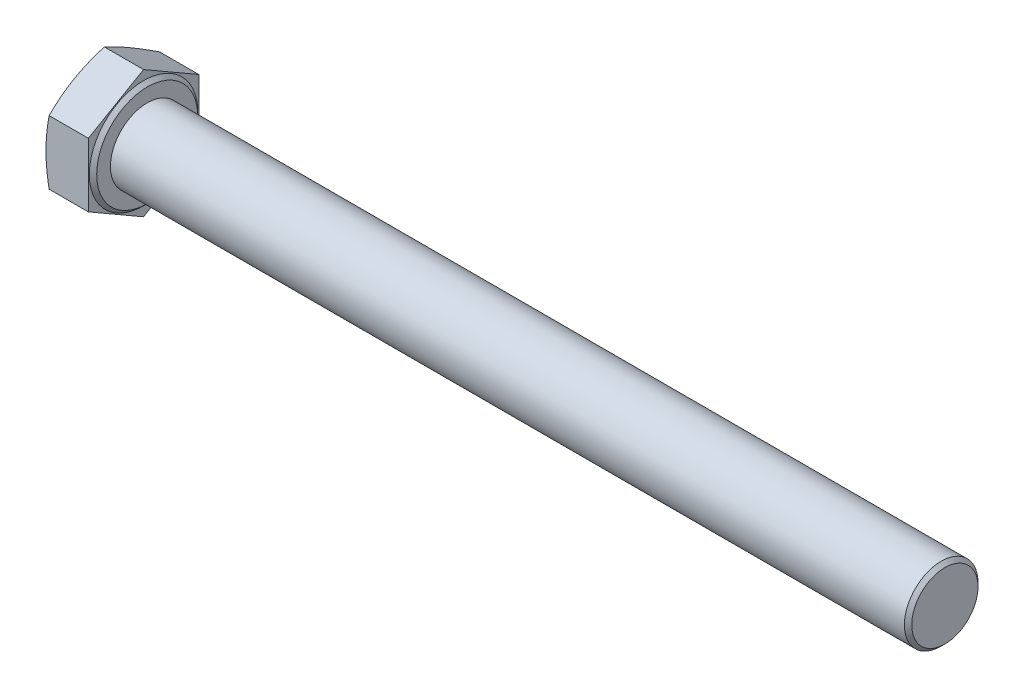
ISO-10303-21;
HEADER;
FILE_DESCRIPTION(('STEP AP214'),'2;1');
FILE_NAME('part.step','',(''),(''),'','','');
FILE_SCHEMA(('AUTOMOTIVE_DESIGN { 1 0 10303 214 1 1 1 1 }'));
ENDSEC;
DATA;
#1=APPLICATION_CONTEXT('core data for automotive mechanical design processes');
#2=APPLICATION_PROTOCOL_DEFINITION('international standard','automotive_design',2000,#1);
#3=PRODUCT_CONTEXT('',#1,'mechanical');
#4=PRODUCT('Part','Part','',(#3));
#5=PRODUCT_RELATED_PRODUCT_CATEGORY('part','',(#4));
#6=PRODUCT_DEFINITION_FORMATION('','',#4);
#7=PRODUCT_DEFINITION_CONTEXT('part definition',#1,'design');
#8=PRODUCT_DEFINITION('design','',#6,#7);
#9=PRODUCT_DEFINITION_SHAPE('','',#8);
#10=(LENGTH_UNIT() NAMED_UNIT(*) SI_UNIT(.MILLI.,.METRE.));
#11=(NAMED_UNIT(*) PLANE_ANGLE_UNIT() SI_UNIT($,.RADIAN.));
#12=(NAMED_UNIT(*) SI_UNIT($,.STERADIAN.) SOLID_ANGLE_UNIT());
#13=UNCERTAINTY_MEASURE_WITH_UNIT(LENGTH_MEASURE(1.E-05),#10,'distance_accuracy_value','');
#14=(GEOMETRIC_REPRESENTATION_CONTEXT(3) GLOBAL_UNCERTAINTY_ASSIGNED_CONTEXT((#13)) GLOBAL_UNIT_ASSIGNED_CONTEXT((#10,
#11,#12)) REPRESENTATION_CONTEXT('',''));
#15=CARTESIAN_POINT('',(0.,0.,0.));
#16=DIRECTION('',(0.,0.,1.));
#17=DIRECTION('',(1.,0.,0.));
#18=AXIS2_PLACEMENT_3D('',#15,#16,#17);
#19=CARTESIAN_POINT('',(7.5,0.,18.));
#20=DIRECTION('',(-1.,0.,0.));
#21=DIRECTION('',(0.,0.,1.));
#22=AXIS2_PLACEMENT_3D('',#19,#20,#21);
#23=PLANE('',#22);
#24=CARTESIAN_POINT('',(7.5,0.,0.));
#25=DIRECTION('',(-1.,0.,0.));
#26=DIRECTION('',(0.,0.,1.));
#27=AXIS2_PLACEMENT_3D('',#24,#25,#26);
#28=CIRCLE('',#27,8.235);
#29=CARTESIAN_POINT('',(7.5,0.,8.235));
#30=VERTEX_POINT('',#29);
#31=EDGE_CURVE('E254',#30,#30,#28,.T.);
#32=ORIENTED_EDGE('',*,*,#31,.F.);
#33=EDGE_LOOP('',(#32));
#34=FACE_BOUND('',#33,.T.);
#35=CARTESIAN_POINT('',(7.50000000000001,0.,0.));
#36=DIRECTION('',(-1.,0.,0.));
#37=DIRECTION('',(0.,0.,1.));
#38=AXIS2_PLACEMENT_3D('',#35,#36,#37);
#39=CIRCLE('',#38,6.);
#40=CARTESIAN_POINT('',(7.50000000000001,0.,6.));
#41=VERTEX_POINT('',#40);
#42=EDGE_CURVE('E149',#41,#41,#39,.F.);
#43=ORIENTED_EDGE('',*,*,#42,.F.);
#44=EDGE_LOOP('',(#43));
#45=FACE_BOUND('',#44,.T.);
#46=ADVANCED_FACE('F31',(#34,#45),#23,.F.);
#47=CARTESIAN_POINT('',(7.5,-5.19615242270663,9.));
#48=DIRECTION('',(0.,0.866025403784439,-0.5));
#49=DIRECTION('',(0.,0.5,0.866025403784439));
#50=AXIS2_PLACEMENT_3D('',#47,#48,#49);
#51=PLANE('',#50);
#52=CARTESIAN_POINT('',(0.506799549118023,-10.3924203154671,-0.000200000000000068));
#53=CARTESIAN_POINT('',(0.428447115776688,-10.1772266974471,0.37252627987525));
#54=CARTESIAN_POINT('',(0.357172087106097,-9.96132347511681,0.746481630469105));
#55=CARTESIAN_POINT('',(0.231774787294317,-9.52811323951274,1.49682376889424));
#56=CARTESIAN_POINT('',(0.177665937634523,-9.31080526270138,1.87321222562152));
#57=CARTESIAN_POINT('',(0.0901464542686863,-8.87719707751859,2.62424363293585));
#58=CARTESIAN_POINT('',(0.0565449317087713,-8.66090677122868,2.9988694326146));
#59=CARTESIAN_POINT('',(0.0114758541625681,-8.22782037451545,3.74899707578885));
#60=CARTESIAN_POINT('',(0.,-8.0110245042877,4.12449853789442));
#61=CARTESIAN_POINT('',(0.,-7.57743276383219,4.87550146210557));
#62=CARTESIAN_POINT('',(0.0114758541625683,-7.36063689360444,5.25100292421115));
#63=CARTESIAN_POINT('',(0.0565449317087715,-6.92755049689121,6.0011305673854));
#64=CARTESIAN_POINT('',(0.0901464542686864,-6.7112601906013,6.37575636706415));
#65=CARTESIAN_POINT('',(0.177665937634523,-6.27765200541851,7.12678777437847));
#66=CARTESIAN_POINT('',(0.231774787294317,-6.06034402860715,7.50317623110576));
#67=CARTESIAN_POINT('',(0.357172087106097,-5.62713379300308,8.25351836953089));
#68=CARTESIAN_POINT('',(0.428447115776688,-5.41123057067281,8.62747372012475));
#69=CARTESIAN_POINT('',(0.506799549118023,-5.19603695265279,9.0002));
#70=B_SPLINE_CURVE_WITH_KNOTS('',3,(#52,#53,#54,#55,#56,#57,#58,#59,#60,#61,#62,#63,#64,#65,#66,
#67,#68,#69),.UNSPECIFIED.,.F.,.F.,(4,2,2,2,2,2,2,2,4),(0.,1.3125188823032,2.62606145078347,
3.9271828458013,5.22781610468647,6.52844936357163,7.82957075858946,9.14311332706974,
10.4556322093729),.UNSPECIFIED.);
#71=CARTESIAN_POINT('',(0.506757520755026,-10.3923048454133,0.));
#72=VERTEX_POINT('',#71);
#73=CARTESIAN_POINT('',(0.,-7.79422863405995,4.5));
#74=VERTEX_POINT('',#73);
#75=EDGE_CURVE('E273',#72,#74,#70,.T.);
#76=ORIENTED_EDGE('',*,*,#75,.F.);
#77=DIRECTION('',(-1.,0.,0.));
#78=VECTOR('',#77,1.);
#79=CARTESIAN_POINT('',(7.5,-10.3923048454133,0.));
#80=LINE('',#79,#78);
#81=CARTESIAN_POINT('',(6.9,-10.3923048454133,0.));
#82=VERTEX_POINT('',#81);
#83=EDGE_CURVE('E142',#82,#72,#80,.T.);
#84=ORIENTED_EDGE('',*,*,#83,.F.);
#85=DIRECTION('',(0.,-0.5,-0.866025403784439));
#86=VECTOR('',#85,1.);
#87=CARTESIAN_POINT('',(6.9,-5.19615242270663,9.));
#88=LINE('',#87,#86);
#89=CARTESIAN_POINT('',(6.9,-5.19615242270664,9.));
#90=VERTEX_POINT('',#89);
#91=EDGE_CURVE('E133',#90,#82,#88,.T.);
#92=ORIENTED_EDGE('',*,*,#91,.F.);
#93=DIRECTION('',(-1.,0.,0.));
#94=VECTOR('',#93,1.);
#95=CARTESIAN_POINT('',(7.5,-5.19615242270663,9.));
#96=LINE('',#95,#94);
#97=CARTESIAN_POINT('',(0.506757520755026,-5.19615242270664,9.));
#98=VERTEX_POINT('',#97);
#99=EDGE_CURVE('E128',#90,#98,#96,.T.);
#100=ORIENTED_EDGE('',*,*,#99,.T.);
#101=EDGE_CURVE('E122',#74,#98,#70,.T.);
#102=ORIENTED_EDGE('',*,*,#101,.F.);
#103=EDGE_LOOP('',(#76,#84,#92,#100,#102));
#104=FACE_BOUND('',#103,.T.);
#105=ADVANCED_FACE('F165',(#104),#51,.F.);
#106=CARTESIAN_POINT('',(7.5,-10.3923048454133,0.));
#107=DIRECTION('',(0.,0.866025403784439,0.5));
#108=DIRECTION('',(0.,-0.5,0.866025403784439));
#109=AXIS2_PLACEMENT_3D('',#106,#107,#108);
#110=PLANE('',#109);
#111=CARTESIAN_POINT('',(0.506799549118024,-5.1960369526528,-9.0002));
#112=CARTESIAN_POINT('',(0.428447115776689,-5.41123057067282,-8.62747372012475));
#113=CARTESIAN_POINT('',(0.357172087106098,-5.62713379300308,-8.25351836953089));
#114=CARTESIAN_POINT('',(0.231774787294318,-6.06034402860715,-7.50317623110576));
#115=CARTESIAN_POINT('',(0.177665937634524,-6.27765200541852,-7.12678777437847));
#116=CARTESIAN_POINT('',(0.0901464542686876,-6.71126019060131,-6.37575636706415));
#117=CARTESIAN_POINT('',(0.0565449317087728,-6.92755049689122,-6.00113056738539));
#118=CARTESIAN_POINT('',(0.0114758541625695,-7.36063689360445,-5.25100292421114));
#119=CARTESIAN_POINT('',(0.,-7.5774327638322,-4.87550146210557));
#120=CARTESIAN_POINT('',(0.,-8.0110245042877,-4.12449853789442));
#121=CARTESIAN_POINT('',(0.0114758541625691,-8.22782037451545,-3.74899707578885));
#122=CARTESIAN_POINT('',(0.0565449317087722,-8.66090677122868,-2.9988694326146));
#123=CARTESIAN_POINT('',(0.090146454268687,-8.87719707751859,-2.62424363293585));
#124=CARTESIAN_POINT('',(0.177665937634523,-9.31080526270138,-1.87321222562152));
#125=CARTESIAN_POINT('',(0.231774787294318,-9.52811323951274,-1.49682376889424));
#126=CARTESIAN_POINT('',(0.357172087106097,-9.96132347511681,-0.746481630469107));
#127=CARTESIAN_POINT('',(0.428447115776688,-10.1772266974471,-0.372526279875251));
#128=CARTESIAN_POINT('',(0.506799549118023,-10.3924203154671,0.000199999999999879));
#129=B_SPLINE_CURVE_WITH_KNOTS('',3,(#111,#112,#113,#114,#115,#116,#117,#118,#119,#120,#121,
#122,#123,#124,#125,#126,#127,#128),.UNSPECIFIED.,.F.,.F.,(4,2,2,2,2,2,2,2,4),(0.,
1.3125188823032,2.62606145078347,3.92718284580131,5.22781610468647,6.52844936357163,
7.82957075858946,9.14311332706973,10.4556322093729),.UNSPECIFIED.);
#130=CARTESIAN_POINT('',(0.506757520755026,-5.19615242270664,-9.));
#131=VERTEX_POINT('',#130);
#132=CARTESIAN_POINT('',(0.,-7.79422863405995,-4.5));
#133=VERTEX_POINT('',#132);
#134=EDGE_CURVE('E224',#131,#133,#129,.T.);
#135=ORIENTED_EDGE('',*,*,#134,.F.);
#136=DIRECTION('',(-1.,0.,0.));
#137=VECTOR('',#136,1.);
#138=CARTESIAN_POINT('',(7.5,-5.19615242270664,-9.));
#139=LINE('',#138,#137);
#140=CARTESIAN_POINT('',(6.9,-5.19615242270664,-9.));
#141=VERTEX_POINT('',#140);
#142=EDGE_CURVE('E139',#141,#131,#139,.T.);
#143=ORIENTED_EDGE('',*,*,#142,.F.);
#144=DIRECTION('',(0.,0.5,-0.866025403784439));
#145=VECTOR('',#144,1.);
#146=CARTESIAN_POINT('',(6.9,-10.3923048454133,0.));
#147=LINE('',#146,#145);
#148=EDGE_CURVE('E263',#82,#141,#147,.T.);
#149=ORIENTED_EDGE('',*,*,#148,.F.);
#150=ORIENTED_EDGE('',*,*,#83,.T.);
#151=EDGE_CURVE('E219',#133,#72,#129,.T.);
#152=ORIENTED_EDGE('',*,*,#151,.F.);
#153=EDGE_LOOP('',(#135,#143,#149,#150,#152));
#154=FACE_BOUND('',#153,.T.);
#155=ADVANCED_FACE('F171',(#154),#110,.F.);
#156=CARTESIAN_POINT('',(7.5,-5.19615242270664,-9.));
#157=DIRECTION('',(0.,0.,1.));
#158=DIRECTION('',(1.,0.,0.));
#159=AXIS2_PLACEMENT_3D('',#156,#157,#158);
#160=PLANE('',#159);
#161=CARTESIAN_POINT('',(2.70791122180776,-13.7575845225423,-9.));
#162=CARTESIAN_POINT('',(2.5839212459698,-13.3503919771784,-9.));
#163=CARTESIAN_POINT('',(2.46137807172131,-12.9427506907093,-9.));
#164=CARTESIAN_POINT('',(2.21998569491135,-12.126342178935,-9.));
#165=CARTESIAN_POINT('',(2.10113678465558,-11.7175748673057,-9.));
#166=CARTESIAN_POINT('',(1.8677356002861,-10.8979861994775,-9.));
#167=CARTESIAN_POINT('',(1.75319175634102,-10.487162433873,-9.));
#168=CARTESIAN_POINT('',(1.52974170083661,-9.66398668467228,-9.));
#169=CARTESIAN_POINT('',(1.42083538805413,-9.25163472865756,-9.));
#170=CARTESIAN_POINT('',(1.21135598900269,-8.43022329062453,-9.));
#171=CARTESIAN_POINT('',(1.11069671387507,-8.02118589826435,-9.));
#172=CARTESIAN_POINT('',(0.917948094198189,-7.20107569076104,-9.));
#173=CARTESIAN_POINT('',(0.825858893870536,-6.79000284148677,-9.));
#174=CARTESIAN_POINT('',(0.652397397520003,-5.96572973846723,-9.));
#175=CARTESIAN_POINT('',(0.571021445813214,-5.55253026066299,-9.));
#176=CARTESIAN_POINT('',(0.421464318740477,-4.72373239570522,-9.));
#177=CARTESIAN_POINT('',(0.353282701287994,-4.30813408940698,-9.));
#178=CARTESIAN_POINT('',(0.239635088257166,-3.52133656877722,-9.));
#179=CARTESIAN_POINT('',(0.192479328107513,-3.15038372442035,-9.));
#180=CARTESIAN_POINT('',(0.112655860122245,-2.40690946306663,-9.));
#181=CARTESIAN_POINT('',(0.0799877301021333,-2.03438809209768,-9.));
#182=CARTESIAN_POINT('',(0.0307127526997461,-1.28853238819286,-9.));
#183=CARTESIAN_POINT('',(0.0140945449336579,-0.915198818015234,-9.));
#184=CARTESIAN_POINT('',(-0.00223921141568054,-0.168158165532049,-9.));
#185=CARTESIAN_POINT('',(-0.00195487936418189,0.205548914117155,-9.));
#186=CARTESIAN_POINT('',(0.0155452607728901,0.954456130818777,-9.));
#187=CARTESIAN_POINT('',(0.0328469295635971,1.32965422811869,-9.));
#188=CARTESIAN_POINT('',(0.0835855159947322,2.07894837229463,-9.));
#189=CARTESIAN_POINT('',(0.117022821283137,2.45304439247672,-9.));
#190=CARTESIAN_POINT('',(0.198468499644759,3.19994965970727,-9.));
#191=CARTESIAN_POINT('',(0.246489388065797,3.57275752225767,-9.));
#192=CARTESIAN_POINT('',(0.355154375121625,4.31650817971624,-9.));
#193=CARTESIAN_POINT('',(0.415798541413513,4.68745096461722,-9.));
#194=CARTESIAN_POINT('',(0.551226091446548,5.44699131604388,-9.));
#195=CARTESIAN_POINT('',(0.626587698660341,5.83548486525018,-9.));
#196=CARTESIAN_POINT('',(0.787010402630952,6.61047695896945,-9.));
#197=CARTESIAN_POINT('',(0.872072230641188,6.99697535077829,-9.));
#198=CARTESIAN_POINT('',(1.05010924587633,7.76825254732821,-9.));
#199=CARTESIAN_POINT('',(1.14308673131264,8.15303081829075,-9.));
#200=CARTESIAN_POINT('',(1.33544261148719,8.92096645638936,-9.));
#201=CARTESIAN_POINT('',(1.43482085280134,9.30412386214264,-9.));
#202=CARTESIAN_POINT('',(1.63891268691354,10.0695370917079,-9.));
#203=CARTESIAN_POINT('',(1.74363296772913,10.4517911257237,-9.));
#204=CARTESIAN_POINT('',(1.95733368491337,11.2151048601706,-9.));
#205=CARTESIAN_POINT('',(2.06631413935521,11.5961645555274,-9.));
#206=CARTESIAN_POINT('',(2.28775386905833,12.3571985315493,-9.));
#207=CARTESIAN_POINT('',(2.40021254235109,12.7371729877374,-9.));
#208=CARTESIAN_POINT('',(2.62802727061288,13.4962533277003,-9.));
#209=CARTESIAN_POINT('',(2.74338334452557,13.8753592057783,-9.));
#210=CARTESIAN_POINT('',(3.09047392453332,15.0032005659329,-9.));
#211=CARTESIAN_POINT('',(3.32570086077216,15.7508610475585,-9.));
#212=CARTESIAN_POINT('',(3.80282060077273,17.2440807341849,-9.));
#213=CARTESIAN_POINT('',(4.04471372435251,17.9896398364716,-9.));
#214=CARTESIAN_POINT('',(4.53246112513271,19.4763263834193,-9.));
#215=CARTESIAN_POINT('',(4.77829688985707,20.2174599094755,-9.));
#216=CARTESIAN_POINT('',(5.14977758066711,21.3282125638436,-9.));
#217=CARTESIAN_POINT('',(5.27405392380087,21.698290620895,-9.));
#218=CARTESIAN_POINT('',(5.52341076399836,22.4381747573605,-9.));
#219=CARTESIAN_POINT('',(5.64849125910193,22.8079808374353,-9.));
#220=CARTESIAN_POINT('',(5.7739201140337,23.1776687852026,-9.));
#221=B_SPLINE_CURVE_WITH_KNOTS('',3,(#161,#162,#163,#164,#165,#166,#167,#168,#169,#170,#171,
#172,#173,#174,#175,#176,#177,#178,#179,#180,#181,#182,#183,#184,#185,#186,#187,#188,#189,#190,
#191,#192,#193,#194,#195,#196,#197,#198,#199,#200,#201,#202,#203,#204,#205,#206,#207,#208,#209,
#210,#211,#212,#213,#214,#215,#216,#217,#218,#219,#220),.UNSPECIFIED.,.F.,.F.,(4,2,2,2,2,2,2,2,
2,2,2,2,2,2,2,2,2,2,2,2,2,2,2,2,2,2,2,2,2,4),(0.,1.27696384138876,2.55402846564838,
3.83347577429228,5.1129001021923,6.37654978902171,7.64022073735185,8.90345935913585,
10.1666556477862,11.2882235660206,12.4097587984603,13.5304996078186,14.6512325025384,
15.777649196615,16.9040929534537,18.0315061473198,19.1589253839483,20.3459801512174,
21.5331244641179,22.7206146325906,23.9080763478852,25.0970630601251,26.2860548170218,
27.4748419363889,28.6636368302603,31.0149581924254,33.3663925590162,35.7089047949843,
36.8800665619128,38.0512254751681),.UNSPECIFIED.);
#222=CARTESIAN_POINT('',(0.506757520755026,5.19615242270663,-9.00000000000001));
#223=VERTEX_POINT('',#222);
#224=CARTESIAN_POINT('',(0.,0.,-9.));
#225=VERTEX_POINT('',#224);
#226=EDGE_CURVE('E298',#223,#225,#221,.F.);
#227=ORIENTED_EDGE('',*,*,#226,.F.);
#228=DIRECTION('',(-1.,0.,0.));
#229=VECTOR('',#228,1.);
#230=CARTESIAN_POINT('',(7.5,5.19615242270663,-9.));
#231=LINE('',#230,#229);
#232=CARTESIAN_POINT('',(6.9,5.19615242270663,-9.));
#233=VERTEX_POINT('',#232);
#234=EDGE_CURVE('E130',#233,#223,#231,.T.);
#235=ORIENTED_EDGE('',*,*,#234,.F.);
#236=DIRECTION('',(0.,1.,0.));
#237=VECTOR('',#236,1.);
#238=CARTESIAN_POINT('',(6.9,-5.19615242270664,-9.));
#239=LINE('',#238,#237);
#240=EDGE_CURVE('E256',#141,#233,#239,.T.);
#241=ORIENTED_EDGE('',*,*,#240,.F.);
#242=ORIENTED_EDGE('',*,*,#142,.T.);
#243=EDGE_CURVE('E225',#225,#131,#221,.F.);
#244=ORIENTED_EDGE('',*,*,#243,.F.);
#245=EDGE_LOOP('',(#227,#235,#241,#242,#244));
#246=FACE_BOUND('',#245,.T.);
#247=ADVANCED_FACE('F233',(#246),#160,.F.);
#248=CARTESIAN_POINT('',(7.5,5.19615242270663,-9.));
#249=DIRECTION('',(0.,-0.866025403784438,0.5));
#250=DIRECTION('',(0.,-0.5,-0.866025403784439));
#251=AXIS2_PLACEMENT_3D('',#248,#249,#250);
#252=PLANE('',#251);
#253=CARTESIAN_POINT('',(0.506799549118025,10.3924203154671,0.000199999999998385));
#254=CARTESIAN_POINT('',(0.428447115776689,10.1772266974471,-0.372526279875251));
#255=CARTESIAN_POINT('',(0.357172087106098,9.96132347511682,-0.746481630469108));
#256=CARTESIAN_POINT('',(0.231774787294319,9.52811323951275,-1.49682376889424));
#257=CARTESIAN_POINT('',(0.177665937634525,9.31080526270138,-1.87321222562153));
#258=CARTESIAN_POINT('',(0.0901464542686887,8.87719707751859,-2.62424363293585));
#259=CARTESIAN_POINT('',(0.0565449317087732,8.66090677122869,-2.9988694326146));
#260=CARTESIAN_POINT('',(0.01147585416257,8.22782037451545,-3.74899707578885));
#261=CARTESIAN_POINT('',(0.,8.0110245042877,-4.12449853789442));
#262=CARTESIAN_POINT('',(0.,7.5774327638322,-4.87550146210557));
#263=CARTESIAN_POINT('',(0.0114758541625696,7.36063689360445,-5.25100292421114));
#264=CARTESIAN_POINT('',(0.0565449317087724,6.92755049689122,-6.00113056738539));
#265=CARTESIAN_POINT('',(0.0901464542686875,6.71126019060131,-6.37575636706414));
#266=CARTESIAN_POINT('',(0.177665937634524,6.27765200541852,-7.12678777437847));
#267=CARTESIAN_POINT('',(0.231774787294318,6.06034402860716,-7.50317623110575));
#268=CARTESIAN_POINT('',(0.357172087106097,5.62713379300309,-8.25351836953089));
#269=CARTESIAN_POINT('',(0.428447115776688,5.41123057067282,-8.62747372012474));
#270=CARTESIAN_POINT('',(0.506799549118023,5.1960369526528,-9.00019999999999));
#271=B_SPLINE_CURVE_WITH_KNOTS('',3,(#253,#254,#255,#256,#257,#258,#259,#260,#261,#262,#263,
#264,#265,#266,#267,#268,#269,#270),.UNSPECIFIED.,.F.,.F.,(4,2,2,2,2,2,2,2,4),(0.,
1.3125188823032,2.62606145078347,3.9271828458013,5.22781610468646,6.52844936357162,
7.82957075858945,9.14311332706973,10.4556322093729),.UNSPECIFIED.);
#272=CARTESIAN_POINT('',(0.506757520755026,10.3923048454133,0.));
#273=VERTEX_POINT('',#272);
#274=CARTESIAN_POINT('',(0.,7.79422863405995,-4.5));
#275=VERTEX_POINT('',#274);
#276=EDGE_CURVE('E214',#273,#275,#271,.T.);
#277=ORIENTED_EDGE('',*,*,#276,.F.);
#278=DIRECTION('',(-1.,0.,0.));
#279=VECTOR('',#278,1.);
#280=CARTESIAN_POINT('',(7.5,10.3923048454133,0.));
#281=LINE('',#280,#279);
#282=CARTESIAN_POINT('',(6.9,10.3923048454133,0.));
#283=VERTEX_POINT('',#282);
#284=EDGE_CURVE('E127',#283,#273,#281,.T.);
#285=ORIENTED_EDGE('',*,*,#284,.F.);
#286=DIRECTION('',(0.,0.5,0.866025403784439));
#287=VECTOR('',#286,1.);
#288=CARTESIAN_POINT('',(6.9,5.19615242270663,-9.));
#289=LINE('',#288,#287);
#290=EDGE_CURVE('E253',#233,#283,#289,.T.);
#291=ORIENTED_EDGE('',*,*,#290,.F.);
#292=ORIENTED_EDGE('',*,*,#234,.T.);
#293=EDGE_CURVE('E250',#275,#223,#271,.T.);
#294=ORIENTED_EDGE('',*,*,#293,.F.);
#295=EDGE_LOOP('',(#277,#285,#291,#292,#294));
#296=FACE_BOUND('',#295,.T.);
#297=ADVANCED_FACE('F238',(#296),#252,.F.);
#298=CARTESIAN_POINT('',(7.5,10.3923048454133,0.));
#299=DIRECTION('',(0.,-0.866025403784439,-0.5));
#300=DIRECTION('',(0.,0.5,-0.866025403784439));
#301=AXIS2_PLACEMENT_3D('',#298,#299,#300);
#302=PLANE('',#301);
#303=CARTESIAN_POINT('',(0.506799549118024,5.19603695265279,9.0002));
#304=CARTESIAN_POINT('',(0.428447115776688,5.41123057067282,8.62747372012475));
#305=CARTESIAN_POINT('',(0.357172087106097,5.62713379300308,8.25351836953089));
#306=CARTESIAN_POINT('',(0.231774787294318,6.06034402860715,7.50317623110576));
#307=CARTESIAN_POINT('',(0.177665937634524,6.27765200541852,7.12678777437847));
#308=CARTESIAN_POINT('',(0.0901464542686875,6.71126019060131,6.37575636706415));
#309=CARTESIAN_POINT('',(0.0565449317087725,6.92755049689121,6.0011305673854));
#310=CARTESIAN_POINT('',(0.0114758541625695,7.36063689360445,5.25100292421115));
#311=CARTESIAN_POINT('',(0.,7.5774327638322,4.87550146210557));
#312=CARTESIAN_POINT('',(0.,8.0110245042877,4.12449853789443));
#313=CARTESIAN_POINT('',(0.0114758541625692,8.22782037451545,3.74899707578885));
#314=CARTESIAN_POINT('',(0.0565449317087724,8.66090677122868,2.9988694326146));
#315=CARTESIAN_POINT('',(0.0901464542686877,8.87719707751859,2.62424363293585));
#316=CARTESIAN_POINT('',(0.177665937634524,9.31080526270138,1.87321222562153));
#317=CARTESIAN_POINT('',(0.231774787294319,9.52811323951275,1.49682376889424));
#318=CARTESIAN_POINT('',(0.357172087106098,9.96132347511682,0.746481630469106));
#319=CARTESIAN_POINT('',(0.428447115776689,10.1772266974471,0.372526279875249));
#320=CARTESIAN_POINT('',(0.506799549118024,10.3924203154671,-0.000200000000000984));
#321=B_SPLINE_CURVE_WITH_KNOTS('',3,(#303,#304,#305,#306,#307,#308,#309,#310,#311,#312,#313,
#314,#315,#316,#317,#318,#319,#320),.UNSPECIFIED.,.F.,.F.,(4,2,2,2,2,2,2,2,4),(0.,
1.3125188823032,2.62606145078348,3.92718284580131,5.22781610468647,6.52844936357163,
7.82957075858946,9.14311332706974,10.4556322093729),.UNSPECIFIED.);
#322=CARTESIAN_POINT('',(0.506757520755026,5.19615242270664,9.));
#323=VERTEX_POINT('',#322);
#324=CARTESIAN_POINT('',(0.,7.79422863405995,4.5));
#325=VERTEX_POINT('',#324);
#326=EDGE_CURVE('E107',#323,#325,#321,.T.);
#327=ORIENTED_EDGE('',*,*,#326,.F.);
#328=DIRECTION('',(-1.,0.,0.));
#329=VECTOR('',#328,1.);
#330=CARTESIAN_POINT('',(7.5,5.19615242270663,9.));
#331=LINE('',#330,#329);
#332=CARTESIAN_POINT('',(6.9,5.19615242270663,9.));
#333=VERTEX_POINT('',#332);
#334=EDGE_CURVE('E119',#333,#323,#331,.T.);
#335=ORIENTED_EDGE('',*,*,#334,.F.);
#336=DIRECTION('',(0.,-0.5,0.866025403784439));
#337=VECTOR('',#336,1.);
#338=CARTESIAN_POINT('',(6.9,10.3923048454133,0.));
#339=LINE('',#338,#337);
#340=EDGE_CURVE('E54',#283,#333,#339,.T.);
#341=ORIENTED_EDGE('',*,*,#340,.F.);
#342=ORIENTED_EDGE('',*,*,#284,.T.);
#343=EDGE_CURVE('E121',#325,#273,#321,.T.);
#344=ORIENTED_EDGE('',*,*,#343,.F.);
#345=EDGE_LOOP('',(#327,#335,#341,#342,#344));
#346=FACE_BOUND('',#345,.T.);
#347=ADVANCED_FACE('F118',(#346),#302,.F.);
#348=CARTESIAN_POINT('',(7.5,5.19615242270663,9.));
#349=DIRECTION('',(0.,0.,-1.));
#350=DIRECTION('',(-1.,0.,0.));
#351=AXIS2_PLACEMENT_3D('',#348,#349,#350);
#352=PLANE('',#351);
#353=CARTESIAN_POINT('',(2.70791122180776,-13.7575845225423,9.));
#354=CARTESIAN_POINT('',(2.5839212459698,-13.3503919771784,9.));
#355=CARTESIAN_POINT('',(2.46137807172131,-12.9427506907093,9.));
#356=CARTESIAN_POINT('',(2.21998569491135,-12.126342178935,9.));
#357=CARTESIAN_POINT('',(2.10113678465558,-11.7175748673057,9.));
#358=CARTESIAN_POINT('',(1.8677356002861,-10.8979861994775,9.));
#359=CARTESIAN_POINT('',(1.75319175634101,-10.487162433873,9.));
#360=CARTESIAN_POINT('',(1.52974170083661,-9.66398668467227,9.));
#361=CARTESIAN_POINT('',(1.42083538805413,-9.25163472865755,9.));
#362=CARTESIAN_POINT('',(1.21135598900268,-8.43022329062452,9.));
#363=CARTESIAN_POINT('',(1.11069671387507,-8.02118589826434,9.));
#364=CARTESIAN_POINT('',(0.917948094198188,-7.20107569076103,9.));
#365=CARTESIAN_POINT('',(0.825858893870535,-6.79000284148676,9.));
#366=CARTESIAN_POINT('',(0.652397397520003,-5.96572973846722,9.));
#367=CARTESIAN_POINT('',(0.571021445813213,-5.55253026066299,9.));
#368=CARTESIAN_POINT('',(0.421464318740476,-4.72373239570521,9.));
#369=CARTESIAN_POINT('',(0.353282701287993,-4.30813408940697,9.));
#370=CARTESIAN_POINT('',(0.239635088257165,-3.52133656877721,9.));
#371=CARTESIAN_POINT('',(0.192479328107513,-3.15038372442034,9.));
#372=CARTESIAN_POINT('',(0.112655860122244,-2.40690946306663,9.));
#373=CARTESIAN_POINT('',(0.0799877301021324,-2.03438809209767,9.));
#374=CARTESIAN_POINT('',(0.0307127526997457,-1.28853238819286,9.));
#375=CARTESIAN_POINT('',(0.0140945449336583,-0.915198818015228,9.));
#376=CARTESIAN_POINT('',(-0.00223921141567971,-0.168158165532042,9.));
#377=CARTESIAN_POINT('',(-0.00195487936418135,0.205548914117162,9.));
#378=CARTESIAN_POINT('',(0.0155452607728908,0.954456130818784,9.));
#379=CARTESIAN_POINT('',(0.0328469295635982,1.3296542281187,9.));
#380=CARTESIAN_POINT('',(0.0835855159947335,2.07894837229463,9.));
#381=CARTESIAN_POINT('',(0.117022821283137,2.45304439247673,9.));
#382=CARTESIAN_POINT('',(0.19846849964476,3.19994965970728,9.));
#383=CARTESIAN_POINT('',(0.246489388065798,3.57275752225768,9.));
#384=CARTESIAN_POINT('',(0.355154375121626,4.31650817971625,9.));
#385=CARTESIAN_POINT('',(0.415798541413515,4.68745096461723,9.));
#386=CARTESIAN_POINT('',(0.55122609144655,5.44699131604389,9.));
#387=CARTESIAN_POINT('',(0.626587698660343,5.83548486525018,9.));
#388=CARTESIAN_POINT('',(0.787010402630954,6.61047695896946,9.));
#389=CARTESIAN_POINT('',(0.872072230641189,6.99697535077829,9.));
#390=CARTESIAN_POINT('',(1.05010924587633,7.76825254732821,9.));
#391=CARTESIAN_POINT('',(1.14308673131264,8.15303081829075,9.));
#392=CARTESIAN_POINT('',(1.33544261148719,8.92096645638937,9.));
#393=CARTESIAN_POINT('',(1.43482085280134,9.30412386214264,9.));
#394=CARTESIAN_POINT('',(1.63891268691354,10.0695370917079,9.));
#395=CARTESIAN_POINT('',(1.74363296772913,10.4517911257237,9.));
#396=CARTESIAN_POINT('',(1.95733368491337,11.2151048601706,9.));
#397=CARTESIAN_POINT('',(2.06631413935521,11.5961645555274,9.));
#398=CARTESIAN_POINT('',(2.28775386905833,12.3571985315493,9.));
#399=CARTESIAN_POINT('',(2.40021254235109,12.7371729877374,9.));
#400=CARTESIAN_POINT('',(2.62802727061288,13.4962533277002,9.));
#401=CARTESIAN_POINT('',(2.74338334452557,13.8753592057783,9.));
#402=CARTESIAN_POINT('',(3.09047392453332,15.0032005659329,9.));
#403=CARTESIAN_POINT('',(3.32570086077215,15.7508610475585,9.));
#404=CARTESIAN_POINT('',(3.80282060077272,17.2440807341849,9.));
#405=CARTESIAN_POINT('',(4.0447137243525,17.9896398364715,9.));
#406=CARTESIAN_POINT('',(4.5324611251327,19.4763263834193,9.));
#407=CARTESIAN_POINT('',(4.77829688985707,20.2174599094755,9.));
#408=CARTESIAN_POINT('',(5.14977758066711,21.3282125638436,9.));
#409=CARTESIAN_POINT('',(5.27405392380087,21.698290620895,9.));
#410=CARTESIAN_POINT('',(5.52341076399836,22.4381747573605,9.));
#411=CARTESIAN_POINT('',(5.64849125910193,22.8079808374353,9.));
#412=CARTESIAN_POINT('',(5.7739201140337,23.1776687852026,9.));
#413=B_SPLINE_CURVE_WITH_KNOTS('',3,(#353,#354,#355,#356,#357,#358,#359,#360,#361,#362,#363,
#364,#365,#366,#367,#368,#369,#370,#371,#372,#373,#374,#375,#376,#377,#378,#379,#380,#381,#382,
#383,#384,#385,#386,#387,#388,#389,#390,#391,#392,#393,#394,#395,#396,#397,#398,#399,#400,#401,
#402,#403,#404,#405,#406,#407,#408,#409,#410,#411,#412),.UNSPECIFIED.,.F.,.F.,(4,2,2,2,2,2,2,2,
2,2,2,2,2,2,2,2,2,2,2,2,2,2,2,2,2,2,2,2,2,4),(0.,1.27696384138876,2.55402846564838,
3.83347577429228,5.1129001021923,6.37654978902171,7.64022073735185,8.90345935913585,
10.1666556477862,11.2882235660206,12.4097587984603,13.5304996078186,14.6512325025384,
15.777649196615,16.9040929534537,18.0315061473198,19.1589253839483,20.3459801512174,
21.5331244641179,22.7206146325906,23.9080763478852,25.0970630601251,26.2860548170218,
27.4748419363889,28.6636368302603,31.0149581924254,33.3663925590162,35.7089047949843,
36.8800665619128,38.0512254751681),.UNSPECIFIED.);
#414=CARTESIAN_POINT('',(0.,0.,9.));
#415=VERTEX_POINT('',#414);
#416=EDGE_CURVE('E113',#98,#415,#413,.T.);
#417=ORIENTED_EDGE('',*,*,#416,.F.);
#418=ORIENTED_EDGE('',*,*,#99,.F.);
#419=DIRECTION('',(0.,-1.,0.));
#420=VECTOR('',#419,1.);
#421=CARTESIAN_POINT('',(6.9,5.19615242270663,9.));
#422=LINE('',#421,#420);
#423=EDGE_CURVE('E126',#333,#90,#422,.T.);
#424=ORIENTED_EDGE('',*,*,#423,.F.);
#425=ORIENTED_EDGE('',*,*,#334,.T.);
#426=EDGE_CURVE('E104',#415,#323,#413,.T.);
#427=ORIENTED_EDGE('',*,*,#426,.F.);
#428=EDGE_LOOP('',(#417,#418,#424,#425,#427));
#429=FACE_BOUND('',#428,.T.);
#430=ADVANCED_FACE('F124',(#429),#352,.F.);
#431=CARTESIAN_POINT('',(6.9,8.83500000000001,0.));
#432=DIRECTION('',(1.,0.,0.));
#433=DIRECTION('',(0.,0.,-1.));
#434=AXIS2_PLACEMENT_3D('',#431,#432,#433);
#435=PLANE('',#434);
#436=CARTESIAN_POINT('',(6.9,0.,0.));
#437=DIRECTION('',(-1.,0.,0.));
#438=DIRECTION('',(0.,0.,1.));
#439=AXIS2_PLACEMENT_3D('',#436,#437,#438);
#440=CIRCLE('',#439,8.83500000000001);
#441=CARTESIAN_POINT('',(6.9,0.,8.83500000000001));
#442=VERTEX_POINT('',#441);
#443=EDGE_CURVE('E259',#442,#442,#440,.T.);
#444=ORIENTED_EDGE('',*,*,#443,.T.);
#445=EDGE_LOOP('',(#444));
#446=FACE_BOUND('',#445,.T.);
#447=ORIENTED_EDGE('',*,*,#91,.T.);
#448=ORIENTED_EDGE('',*,*,#148,.T.);
#449=ORIENTED_EDGE('',*,*,#240,.T.);
#450=ORIENTED_EDGE('',*,*,#290,.T.);
#451=ORIENTED_EDGE('',*,*,#340,.T.);
#452=ORIENTED_EDGE('',*,*,#423,.T.);
#453=EDGE_LOOP('',(#447,#448,#449,#450,#451,#452));
#454=FACE_BOUND('',#453,.T.);
#455=ADVANCED_FACE('F185',(#446,#454),#435,.T.);
#456=CARTESIAN_POINT('',(6.9,0.,0.));
#457=DIRECTION('',(-1.,0.,0.));
#458=DIRECTION('',(0.,0.,1.));
#459=AXIS2_PLACEMENT_3D('',#456,#457,#458);
#460=CONICAL_SURFACE('',#459,8.83500000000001,0.785398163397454);
#461=ORIENTED_EDGE('',*,*,#31,.T.);
#462=EDGE_LOOP('',(#461));
#463=FACE_BOUND('',#462,.T.);
#464=ORIENTED_EDGE('',*,*,#443,.F.);
#465=EDGE_LOOP('',(#464));
#466=FACE_BOUND('',#465,.T.);
#467=ADVANCED_FACE('F177',(#463,#466),#460,.T.);
#468=CARTESIAN_POINT('',(0.,0.,0.));
#469=DIRECTION('',(1.,0.,0.));
#470=DIRECTION('',(0.,0.,-1.));
#471=AXIS2_PLACEMENT_3D('',#468,#469,#470);
#472=CONICAL_SURFACE('',#471,9.,1.22173047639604);
#473=ORIENTED_EDGE('',*,*,#101,.T.);
#474=ORIENTED_EDGE('',*,*,#416,.T.);
#475=CARTESIAN_POINT('',(0.,0.,0.));
#476=DIRECTION('',(-1.,0.,0.));
#477=DIRECTION('',(0.,0.,1.));
#478=AXIS2_PLACEMENT_3D('',#475,#476,#477);
#479=CIRCLE('',#478,9.);
#480=EDGE_CURVE('E46',#74,#415,#479,.T.);
#481=ORIENTED_EDGE('',*,*,#480,.F.);
#482=EDGE_LOOP('',(#473,#474,#481));
#483=FACE_BOUND('',#482,.T.);
#484=ADVANCED_FACE('F277',(#483),#472,.T.);
#485=ORIENTED_EDGE('',*,*,#151,.T.);
#486=ORIENTED_EDGE('',*,*,#75,.T.);
#487=EDGE_CURVE('E147',#133,#74,#479,.T.);
#488=ORIENTED_EDGE('',*,*,#487,.F.);
#489=EDGE_LOOP('',(#485,#486,#488));
#490=FACE_BOUND('',#489,.T.);
#491=ADVANCED_FACE('F286',(#490),#472,.T.);
#492=ORIENTED_EDGE('',*,*,#243,.T.);
#493=ORIENTED_EDGE('',*,*,#134,.T.);
#494=EDGE_CURVE('E281',#225,#133,#479,.T.);
#495=ORIENTED_EDGE('',*,*,#494,.F.);
#496=EDGE_LOOP('',(#492,#493,#495));
#497=FACE_BOUND('',#496,.T.);
#498=ADVANCED_FACE('F202',(#497),#472,.T.);
#499=ORIENTED_EDGE('',*,*,#226,.T.);
#500=EDGE_CURVE('E282',#275,#225,#479,.T.);
#501=ORIENTED_EDGE('',*,*,#500,.F.);
#502=ORIENTED_EDGE('',*,*,#293,.T.);
#503=EDGE_LOOP('',(#499,#501,#502));
#504=FACE_BOUND('',#503,.T.);
#505=ADVANCED_FACE('F197',(#504),#472,.T.);
#506=ORIENTED_EDGE('',*,*,#276,.T.);
#507=EDGE_CURVE('E148',#325,#275,#479,.T.);
#508=ORIENTED_EDGE('',*,*,#507,.F.);
#509=ORIENTED_EDGE('',*,*,#343,.T.);
#510=EDGE_LOOP('',(#506,#508,#509));
#511=FACE_BOUND('',#510,.T.);
#512=ADVANCED_FACE('F201',(#511),#472,.T.);
#513=ORIENTED_EDGE('',*,*,#326,.T.);
#514=CARTESIAN_POINT('',(0.,0.,0.));
#515=DIRECTION('',(-1.,0.,0.));
#516=DIRECTION('',(0.,0.,1.));
#517=AXIS2_PLACEMENT_3D('',#514,#515,#516);
#518=CIRCLE('',#517,9.);
#519=EDGE_CURVE('E109',#415,#325,#518,.T.);
#520=ORIENTED_EDGE('',*,*,#519,.F.);
#521=ORIENTED_EDGE('',*,*,#426,.T.);
#522=EDGE_LOOP('',(#513,#520,#521));
#523=FACE_BOUND('',#522,.T.);
#524=ADVANCED_FACE('F106',(#523),#472,.T.);
#525=CARTESIAN_POINT('',(0.,0.,18.));
#526=DIRECTION('',(-1.,0.,0.));
#527=DIRECTION('',(0.,0.,1.));
#528=AXIS2_PLACEMENT_3D('',#525,#526,#527);
#529=PLANE('',#528);
#530=ORIENTED_EDGE('',*,*,#480,.T.);
#531=ORIENTED_EDGE('',*,*,#519,.T.);
#532=ORIENTED_EDGE('',*,*,#507,.T.);
#533=ORIENTED_EDGE('',*,*,#500,.T.);
#534=ORIENTED_EDGE('',*,*,#494,.T.);
#535=ORIENTED_EDGE('',*,*,#487,.T.);
#536=EDGE_LOOP('',(#530,#531,#532,#533,#534,#535));
#537=FACE_BOUND('',#536,.T.);
#538=ADVANCED_FACE('F179',(#537),#529,.T.);
#539=CARTESIAN_POINT('',(137.5,0.,0.));
#540=DIRECTION('',(-1.,0.,0.));
#541=DIRECTION('',(0.,0.,1.));
#542=AXIS2_PLACEMENT_3D('',#539,#540,#541);
#543=CYLINDRICAL_SURFACE('',#542,6.);
#544=CARTESIAN_POINT('',(136.9,0.,0.));
#545=DIRECTION('',(1.,0.,0.));
#546=DIRECTION('',(0.,0.,-1.));
#547=AXIS2_PLACEMENT_3D('',#544,#545,#546);
#548=CIRCLE('',#547,6.);
#549=CARTESIAN_POINT('',(136.9,0.,-6.));
#550=VERTEX_POINT('',#549);
#551=EDGE_CURVE('E11',#550,#550,#548,.F.);
#552=ORIENTED_EDGE('',*,*,#551,.T.);
#553=EDGE_LOOP('',(#552));
#554=FACE_BOUND('',#553,.T.);
#555=ORIENTED_EDGE('',*,*,#42,.T.);
#556=EDGE_LOOP('',(#555));
#557=FACE_BOUND('',#556,.T.);
#558=ADVANCED_FACE('F161',(#554,#557),#543,.T.);
#559=CARTESIAN_POINT('',(137.5,0.,0.));
#560=DIRECTION('',(1.,0.,0.));
#561=DIRECTION('',(0.,0.,-1.));
#562=AXIS2_PLACEMENT_3D('',#559,#560,#561);
#563=PLANE('',#562);
#564=CARTESIAN_POINT('',(137.5,0.,0.));
#565=DIRECTION('',(1.,0.,0.));
#566=DIRECTION('',(0.,0.,-1.));
#567=AXIS2_PLACEMENT_3D('',#564,#565,#566);
#568=CIRCLE('',#567,5.40000000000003);
#569=CARTESIAN_POINT('',(137.5,0.,-5.40000000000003));
#570=VERTEX_POINT('',#569);
#571=EDGE_CURVE('E39',#570,#570,#568,.T.);
#572=ORIENTED_EDGE('',*,*,#571,.T.);
#573=EDGE_LOOP('',(#572));
#574=FACE_BOUND('',#573,.T.);
#575=ADVANCED_FACE('F154',(#574),#563,.T.);
#576=CARTESIAN_POINT('',(137.5,0.,0.));
#577=DIRECTION('',(-1.,0.,0.));
#578=DIRECTION('',(0.,0.,1.));
#579=AXIS2_PLACEMENT_3D('',#576,#577,#578);
#580=CONICAL_SURFACE('',#579,5.40000000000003,0.785398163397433);
#581=ORIENTED_EDGE('',*,*,#551,.F.);
#582=EDGE_LOOP('',(#581));
#583=FACE_BOUND('',#582,.T.);
#584=ORIENTED_EDGE('',*,*,#571,.F.);
#585=EDGE_LOOP('',(#584));
#586=FACE_BOUND('',#585,.T.);
#587=ADVANCED_FACE('F33',(#583,#586),#580,.T.);
#588=CLOSED_SHELL('',(#46,#105,#155,#247,#297,#347,#430,#455,#467,#484,#491,#498,#505,#512,#524,
#538,#558,#575,#587));
#589=MANIFOLD_SOLID_BREP('B2',#588);
#590=ADVANCED_BREP_SHAPE_REPRESENTATION('',(#18,#589),#14);
#591=SHAPE_DEFINITION_REPRESENTATION(#9,#590);
ENDSEC;
END-ISO-10303-21;
